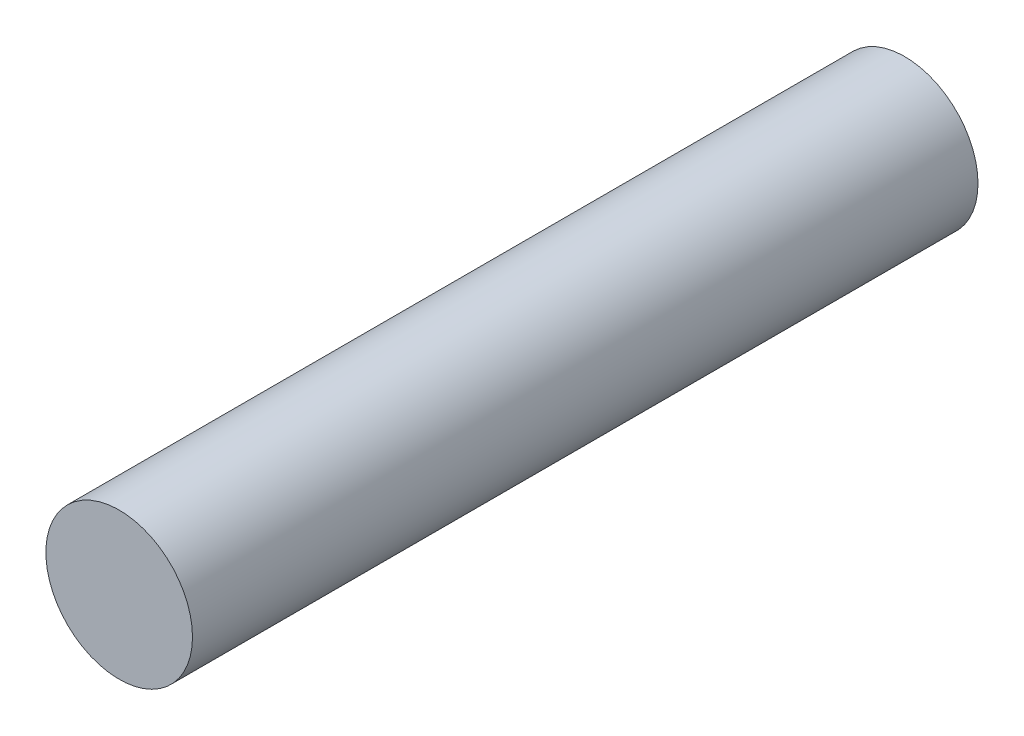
from build123d import *

# Parameters (mm, degrees)
SKETCH1_R           = 7
BOSS_EXTRUDE1_DEPTH = 75


with BuildPart() as part:
    # Sketch1 → Boss-Extrude1 (new body)
    with BuildSketch(Plane.XY):
        Circle(SKETCH1_R)
    extrude(amount=BOSS_EXTRUDE1_DEPTH)


solid = part.part
